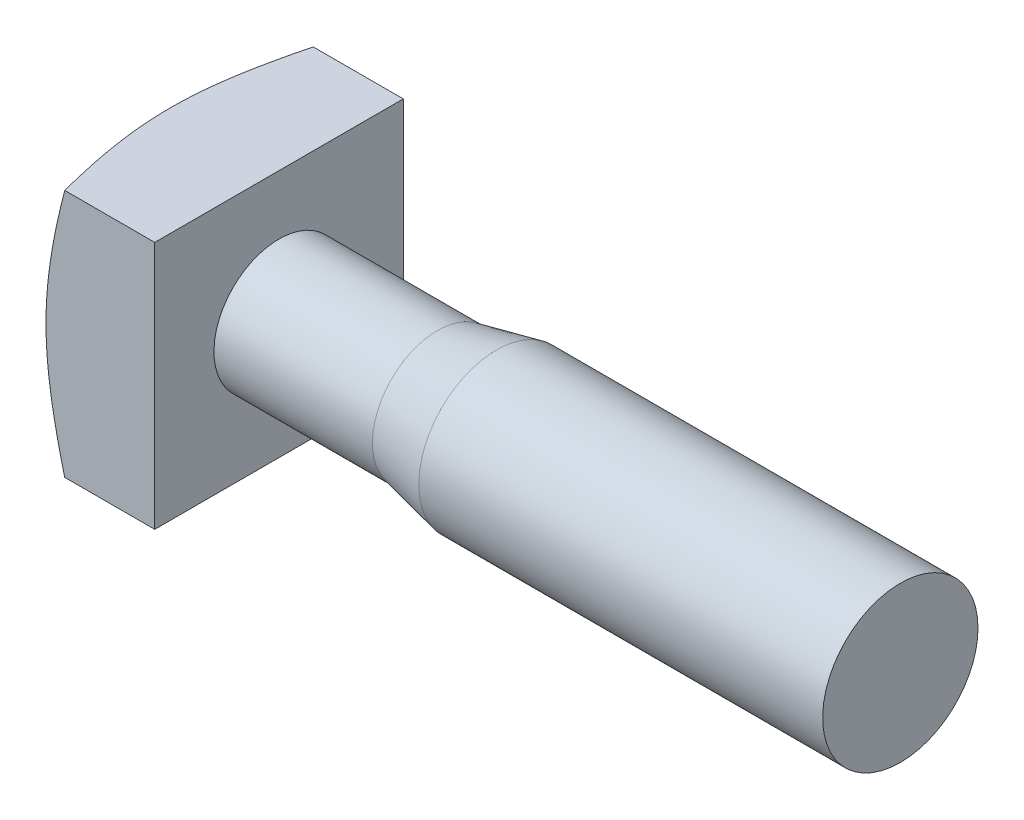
from build123d import *

# Parameters (mm, degrees)
SKETCH1_W      = 16
SKETCH1_H      = 16
BASEHEAD_DEPTH = 7
SKETCH2_R      = 5
BASEBODY_DEPTH = 40


with BuildPart() as part:
    # Sketch1 → BaseHead (new body)
    with BuildSketch(Plane(origin=(0, 0, 0), x_dir=(0, 0, -1), z_dir=(1, 0, 0))):
        Rectangle(SKETCH1_W, SKETCH1_H)
    extrude(amount=BASEHEAD_DEPTH)

    # Sketch4 → HeadChamfer (revolve, cut)
    with BuildSketch(Plane(origin=(-7.181436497, -8, 8), x_dir=(-1, 0, 0), z_dir=(0, -0.7071067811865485, -0.7071067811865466))):
        Polygon((-7.181436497, 19.313708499), (-7.181436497, 22.627416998), (-8.387527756, 22.627416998), align=None)
    revolve(axis=Axis((8.946843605, 0, 0), (-1, 0, 0)), mode=Mode.SUBTRACT)

    # Sketch2 → BaseBody (add)
    with BuildSketch(Plane(origin=(7, 0, 0), x_dir=(0, 0, -1), z_dir=(1, 0, 0))):
        Circle(SKETCH2_R)
    extrude(amount=BASEBODY_DEPTH)

    # Sketch5 → Cut-Revolve1 (revolve, cut)
    with BuildSketch(Plane(origin=(-43.209051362, 5, 0), x_dir=(-1, 0, 0), z_dir=(0, 0, 1))):
        Polygon((-64.209051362, 10), (-50.209051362, 10), (-50.209051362, 9.188), (-60.409051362, 9.188), align=None)
    revolve(axis=Axis((-3.790948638, 0, 0), (1, 0, 0)), mode=Mode.SUBTRACT)


solid = part.part
